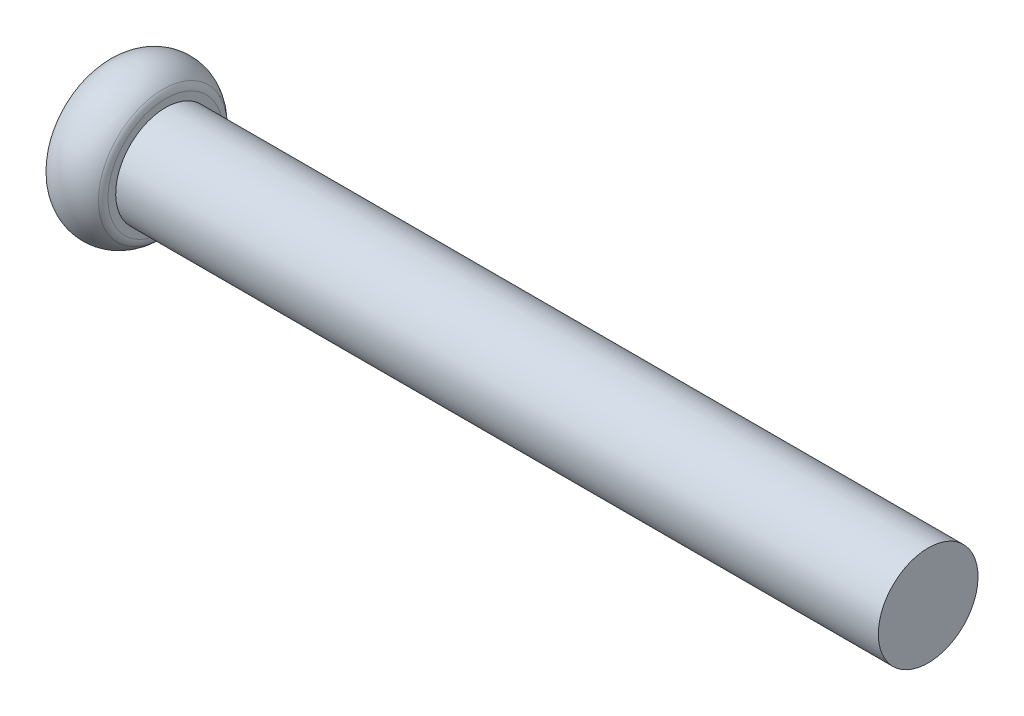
ISO-10303-21;
HEADER;
FILE_DESCRIPTION(('STEP AP214'),'2;1');
FILE_NAME('part.step','',(''),(''),'','','');
FILE_SCHEMA(('AUTOMOTIVE_DESIGN { 1 0 10303 214 1 1 1 1 }'));
ENDSEC;
DATA;
#1=APPLICATION_CONTEXT('core data for automotive mechanical design processes');
#2=APPLICATION_PROTOCOL_DEFINITION('international standard','automotive_design',2000,#1);
#3=PRODUCT_CONTEXT('',#1,'mechanical');
#4=PRODUCT('Part','Part','',(#3));
#5=PRODUCT_RELATED_PRODUCT_CATEGORY('part','',(#4));
#6=PRODUCT_DEFINITION_FORMATION('','',#4);
#7=PRODUCT_DEFINITION_CONTEXT('part definition',#1,'design');
#8=PRODUCT_DEFINITION('design','',#6,#7);
#9=PRODUCT_DEFINITION_SHAPE('','',#8);
#10=(LENGTH_UNIT() NAMED_UNIT(*) SI_UNIT(.MILLI.,.METRE.));
#11=(NAMED_UNIT(*) PLANE_ANGLE_UNIT() SI_UNIT($,.RADIAN.));
#12=(NAMED_UNIT(*) SI_UNIT($,.STERADIAN.) SOLID_ANGLE_UNIT());
#13=UNCERTAINTY_MEASURE_WITH_UNIT(LENGTH_MEASURE(1.E-05),#10,'distance_accuracy_value','');
#14=(GEOMETRIC_REPRESENTATION_CONTEXT(3) GLOBAL_UNCERTAINTY_ASSIGNED_CONTEXT((#13)) GLOBAL_UNIT_ASSIGNED_CONTEXT((#10,
#11,#12)) REPRESENTATION_CONTEXT('',''));
#15=CARTESIAN_POINT('',(0.,0.,0.));
#16=DIRECTION('',(0.,0.,1.));
#17=DIRECTION('',(1.,0.,0.));
#18=AXIS2_PLACEMENT_3D('',#15,#16,#17);
#19=CARTESIAN_POINT('',(0.,0.,0.));
#20=DIRECTION('',(-1.,0.,0.));
#21=DIRECTION('',(0.,-1.,0.));
#22=AXIS2_PLACEMENT_3D('',#19,#20,#21);
#23=PLANE('',#22);
#24=DIRECTION('',(0.,-1.,0.));
#25=VECTOR('',#24,1.);
#26=CARTESIAN_POINT('',(0.,-1.175,-0.299999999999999));
#27=LINE('',#26,#25);
#28=CARTESIAN_POINT('',(0.,-0.300000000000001,-0.299999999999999));
#29=VERTEX_POINT('',#28);
#30=CARTESIAN_POINT('',(0.,-0.734597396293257,-0.3));
#31=VERTEX_POINT('',#30);
#32=EDGE_CURVE('E584',#29,#31,#27,.T.);
#33=ORIENTED_EDGE('',*,*,#32,.F.);
#34=DIRECTION('',(0.,0.,1.));
#35=VECTOR('',#34,1.);
#36=CARTESIAN_POINT('',(0.,-0.299999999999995,1.175));
#37=LINE('',#36,#35);
#38=CARTESIAN_POINT('',(0.,-0.300000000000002,-0.734597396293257));
#39=VERTEX_POINT('',#38);
#40=EDGE_CURVE('E76',#39,#29,#37,.T.);
#41=ORIENTED_EDGE('',*,*,#40,.F.);
#42=CARTESIAN_POINT('',(0.,0.,0.));
#43=DIRECTION('',(1.,0.,0.));
#44=DIRECTION('',(0.,1.,0.));
#45=AXIS2_PLACEMENT_3D('',#42,#43,#44);
#46=CIRCLE('',#45,0.793494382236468);
#47=EDGE_CURVE('E543',#31,#39,#46,.T.);
#48=ORIENTED_EDGE('',*,*,#47,.F.);
#49=EDGE_LOOP('',(#33,#41,#48));
#50=FACE_BOUND('',#49,.T.);
#51=ADVANCED_FACE('F52',(#50),#23,.T.);
#52=CARTESIAN_POINT('',(0.,-0.299999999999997,0.734597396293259));
#53=VERTEX_POINT('',#52);
#54=CARTESIAN_POINT('',(0.,-0.73462282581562,0.299999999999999));
#55=VERTEX_POINT('',#54);
#56=EDGE_CURVE('E611',#53,#55,#46,.T.);
#57=ORIENTED_EDGE('',*,*,#56,.F.);
#58=CARTESIAN_POINT('',(0.,-0.299999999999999,0.3));
#59=VERTEX_POINT('',#58);
#60=EDGE_CURVE('E363',#59,#53,#37,.T.);
#61=ORIENTED_EDGE('',*,*,#60,.F.);
#62=DIRECTION('',(0.,1.,0.));
#63=VECTOR('',#62,1.);
#64=CARTESIAN_POINT('',(0.,1.175,0.299999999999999));
#65=LINE('',#64,#63);
#66=EDGE_CURVE('E586',#55,#59,#65,.T.);
#67=ORIENTED_EDGE('',*,*,#66,.F.);
#68=EDGE_LOOP('',(#57,#61,#67));
#69=FACE_BOUND('',#68,.T.);
#70=ADVANCED_FACE('F641',(#69),#23,.T.);
#71=CARTESIAN_POINT('',(0.,-1.175,0.299999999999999));
#72=DIRECTION('',(-0.0383776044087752,0.,0.999263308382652));
#73=DIRECTION('',(0.999263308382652,0.,0.0383776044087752));
#74=AXIS2_PLACEMENT_3D('',#71,#72,#73);
#75=PLANE('',#74);
#76=DIRECTION('',(-0.998528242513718,0.038349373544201,-0.0383493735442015));
#77=VECTOR('',#76,1.);
#78=CARTESIAN_POINT('',(0.033506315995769,-0.301286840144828,0.301286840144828));
#79=LINE('',#78,#77);
#80=CARTESIAN_POINT('',(1.30188338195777,-0.349999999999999,0.35));
#81=VERTEX_POINT('',#80);
#82=EDGE_CURVE('E544',#81,#59,#79,.T.);
#83=ORIENTED_EDGE('',*,*,#82,.F.);
#84=DIRECTION('',(0.,-1.,0.));
#85=VECTOR('',#84,1.);
#86=CARTESIAN_POINT('',(1.30188338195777,0.44201414,0.35));
#87=LINE('',#86,#85);
#88=CARTESIAN_POINT('',(1.30188338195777,-0.44201414,0.35));
#89=VERTEX_POINT('',#88);
#90=EDGE_CURVE('E392',#81,#89,#87,.T.);
#91=ORIENTED_EDGE('',*,*,#90,.T.);
#92=DIRECTION('',(0.870894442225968,0.490330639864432,0.0334474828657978));
#93=VECTOR('',#92,1.);
#94=CARTESIAN_POINT('',(0.,-1.175,0.299999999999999));
#95=LINE('',#94,#93);
#96=CARTESIAN_POINT('',(0.0983845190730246,-1.1196075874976,0.30377854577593));
#97=VERTEX_POINT('',#96);
#98=EDGE_CURVE('E514',#97,#89,#95,.T.);
#99=ORIENTED_EDGE('',*,*,#98,.F.);
#100=CARTESIAN_POINT('',(0.113438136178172,-1.14520643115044,0.304356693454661));
#101=CARTESIAN_POINT('',(0.102044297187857,-1.12668976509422,0.303919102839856));
#102=CARTESIAN_POINT('',(0.0914723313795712,-1.10768079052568,0.303513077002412));
#103=CARTESIAN_POINT('',(0.0720202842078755,-1.06882227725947,0.302766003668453));
#104=CARTESIAN_POINT('',(0.0631396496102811,-1.04897301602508,0.302424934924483));
#105=CARTESIAN_POINT('',(0.0393011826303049,-0.988878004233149,0.301509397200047));
#106=CARTESIAN_POINT('',(0.02685416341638,-0.947604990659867,0.301031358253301));
#107=CARTESIAN_POINT('',(0.00886680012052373,-0.863624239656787,0.300340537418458));
#108=CARTESIAN_POINT('',(0.00332567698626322,-0.820916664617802,0.300127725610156));
#109=CARTESIAN_POINT('',(-0.00110919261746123,-0.734894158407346,0.299957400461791));
#110=CARTESIAN_POINT('',(3.9984639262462E-05,-0.691577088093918,0.300001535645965));
#111=CARTESIAN_POINT('',(0.0075445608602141,-0.615029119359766,0.300289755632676));
#112=CARTESIAN_POINT('',(0.0127030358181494,-0.58166944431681,0.300487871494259));
#113=CARTESIAN_POINT('',(0.0262958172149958,-0.515563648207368,0.301009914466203));
#114=CARTESIAN_POINT('',(0.0347369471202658,-0.48281895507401,0.301334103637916));
#115=CARTESIAN_POINT('',(0.0541314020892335,-0.41845677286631,0.302078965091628));
#116=CARTESIAN_POINT('',(0.0650593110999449,-0.386831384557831,0.302498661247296));
#117=CARTESIAN_POINT('',(0.0826187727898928,-0.339928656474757,0.303173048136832));
#118=CARTESIAN_POINT('',(0.088651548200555,-0.324418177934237,0.303404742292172));
#119=CARTESIAN_POINT('',(0.100929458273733,-0.293491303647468,0.303876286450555));
#120=CARTESIAN_POINT('',(0.107174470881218,-0.278074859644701,0.304116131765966));
#121=CARTESIAN_POINT('',(0.11343813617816,-0.262666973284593,0.304356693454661));
#122=B_SPLINE_CURVE_WITH_KNOTS('',3,(#100,#101,#102,#103,#104,#105,#106,#107,#108,#109,#110,
#111,#112,#113,#114,#115,#116,#117,#118,#119,#120,#121),.UNSPECIFIED.,.F.,.F.,(4,2,2,2,2,2,2,2,
2,2,4),(0.,0.0651933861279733,0.13036541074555,0.259044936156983,0.387709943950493,
0.517201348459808,0.618296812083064,0.719603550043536,0.819918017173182,0.869849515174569,
0.919752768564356),.UNSPECIFIED.);
#123=EDGE_CURVE('E482',#97,#55,#122,.T.);
#124=ORIENTED_EDGE('',*,*,#123,.T.);
#125=ORIENTED_EDGE('',*,*,#66,.T.);
#126=EDGE_LOOP('',(#83,#91,#99,#124,#125));
#127=FACE_BOUND('',#126,.T.);
#128=ADVANCED_FACE('F637',(#127),#75,.F.);
#129=CARTESIAN_POINT('',(1.30188338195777,0.44201414,-0.35));
#130=DIRECTION('',(0.0383776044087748,0.,0.999263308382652));
#131=DIRECTION('',(0.999263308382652,0.,-0.0383776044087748));
#132=AXIS2_PLACEMENT_3D('',#129,#130,#131);
#133=PLANE('',#132);
#134=DIRECTION('',(0.,1.,0.));
#135=VECTOR('',#134,1.);
#136=CARTESIAN_POINT('',(1.30188338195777,-0.44201414,-0.35));
#137=LINE('',#136,#135);
#138=CARTESIAN_POINT('',(1.30188338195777,-0.44201414,-0.35));
#139=VERTEX_POINT('',#138);
#140=CARTESIAN_POINT('',(1.30188338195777,-0.350000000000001,-0.35));
#141=VERTEX_POINT('',#140);
#142=EDGE_CURVE('E424',#139,#141,#137,.T.);
#143=ORIENTED_EDGE('',*,*,#142,.T.);
#144=DIRECTION('',(-0.998528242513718,0.0383493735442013,0.0383493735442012));
#145=VECTOR('',#144,1.);
#146=CARTESIAN_POINT('',(1.27155483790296,-0.348835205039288,-0.348835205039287));
#147=LINE('',#146,#145);
#148=EDGE_CURVE('E171',#141,#29,#147,.T.);
#149=ORIENTED_EDGE('',*,*,#148,.T.);
#150=ORIENTED_EDGE('',*,*,#32,.T.);
#151=CARTESIAN_POINT('',(0.113438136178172,-1.14520643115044,-0.304356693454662));
#152=CARTESIAN_POINT('',(0.102044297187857,-1.12668976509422,-0.303919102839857));
#153=CARTESIAN_POINT('',(0.0914723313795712,-1.10768079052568,-0.303513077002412));
#154=CARTESIAN_POINT('',(0.0720202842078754,-1.06882227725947,-0.302766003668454));
#155=CARTESIAN_POINT('',(0.063139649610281,-1.04897301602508,-0.302424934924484));
#156=CARTESIAN_POINT('',(0.0393011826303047,-0.988878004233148,-0.301509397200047));
#157=CARTESIAN_POINT('',(0.0268541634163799,-0.947604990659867,-0.301031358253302));
#158=CARTESIAN_POINT('',(0.00886680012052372,-0.863624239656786,-0.300340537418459));
#159=CARTESIAN_POINT('',(0.00332567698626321,-0.820916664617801,-0.300127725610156));
#160=CARTESIAN_POINT('',(-0.0011091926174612,-0.734894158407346,-0.299957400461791));
#161=CARTESIAN_POINT('',(3.99846392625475E-05,-0.691577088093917,-0.300001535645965));
#162=CARTESIAN_POINT('',(0.00754456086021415,-0.615029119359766,-0.300289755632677));
#163=CARTESIAN_POINT('',(0.0127030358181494,-0.58166944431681,-0.30048787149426));
#164=CARTESIAN_POINT('',(0.0262958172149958,-0.515563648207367,-0.301009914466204));
#165=CARTESIAN_POINT('',(0.0347369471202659,-0.482818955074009,-0.301334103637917));
#166=CARTESIAN_POINT('',(0.0541314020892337,-0.418456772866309,-0.302078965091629));
#167=CARTESIAN_POINT('',(0.065059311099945,-0.386831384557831,-0.302498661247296));
#168=CARTESIAN_POINT('',(0.0826187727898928,-0.339928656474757,-0.303173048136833));
#169=CARTESIAN_POINT('',(0.088651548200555,-0.324418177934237,-0.303404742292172));
#170=CARTESIAN_POINT('',(0.100929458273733,-0.293491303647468,-0.303876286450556));
#171=CARTESIAN_POINT('',(0.107174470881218,-0.278074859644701,-0.304116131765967));
#172=CARTESIAN_POINT('',(0.11343813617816,-0.262666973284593,-0.304356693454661));
#173=B_SPLINE_CURVE_WITH_KNOTS('',3,(#151,#152,#153,#154,#155,#156,#157,#158,#159,#160,#161,
#162,#163,#164,#165,#166,#167,#168,#169,#170,#171,#172),.UNSPECIFIED.,.F.,.F.,(4,2,2,2,2,2,2,2,
2,2,4),(0.,0.0651933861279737,0.13036541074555,0.259044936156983,0.387709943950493,
0.517201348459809,0.618296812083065,0.719603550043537,0.819918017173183,0.869849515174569,
0.919752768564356),.UNSPECIFIED.);
#174=CARTESIAN_POINT('',(0.0983845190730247,-1.1196075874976,-0.30377854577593));
#175=VERTEX_POINT('',#174);
#176=EDGE_CURVE('E471',#175,#31,#173,.T.);
#177=ORIENTED_EDGE('',*,*,#176,.F.);
#178=DIRECTION('',(0.870894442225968,0.490330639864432,-0.0334474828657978));
#179=VECTOR('',#178,1.);
#180=CARTESIAN_POINT('',(0.,-1.175,-0.299999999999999));
#181=LINE('',#180,#179);
#182=EDGE_CURVE('E511',#175,#139,#181,.T.);
#183=ORIENTED_EDGE('',*,*,#182,.T.);
#184=EDGE_LOOP('',(#143,#149,#150,#177,#183));
#185=FACE_BOUND('',#184,.T.);
#186=ADVANCED_FACE('F449',(#185),#133,.T.);
#187=DIRECTION('',(0.,0.,-1.));
#188=VECTOR('',#187,1.);
#189=CARTESIAN_POINT('',(0.,0.299999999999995,-1.175));
#190=LINE('',#189,#188);
#191=CARTESIAN_POINT('',(0.,0.299999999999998,-0.3));
#192=VERTEX_POINT('',#191);
#193=CARTESIAN_POINT('',(0.,0.300003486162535,-0.734589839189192));
#194=VERTEX_POINT('',#193);
#195=EDGE_CURVE('E548',#192,#194,#190,.T.);
#196=ORIENTED_EDGE('',*,*,#195,.F.);
#197=CARTESIAN_POINT('',(0.,0.734597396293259,-0.299999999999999));
#198=VERTEX_POINT('',#197);
#199=EDGE_CURVE('E579',#198,#192,#27,.T.);
#200=ORIENTED_EDGE('',*,*,#199,.F.);
#201=EDGE_CURVE('E580',#194,#198,#46,.T.);
#202=ORIENTED_EDGE('',*,*,#201,.F.);
#203=EDGE_LOOP('',(#196,#200,#202));
#204=FACE_BOUND('',#203,.T.);
#205=ADVANCED_FACE('F578',(#204),#23,.T.);
#206=CARTESIAN_POINT('',(1.30188338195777,1.,0.));
#207=DIRECTION('',(1.,0.,0.));
#208=DIRECTION('',(0.,1.,0.));
#209=AXIS2_PLACEMENT_3D('',#206,#207,#208);
#210=PLANE('',#209);
#211=CARTESIAN_POINT('',(1.30188338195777,0.,0.));
#212=DIRECTION('',(1.,0.,0.));
#213=DIRECTION('',(0.,1.,0.));
#214=AXIS2_PLACEMENT_3D('',#211,#212,#213);
#215=CIRCLE('',#214,1.1549647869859);
#216=CARTESIAN_POINT('',(1.30188338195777,1.1549647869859,0.));
#217=VERTEX_POINT('',#216);
#218=EDGE_CURVE('E60',#217,#217,#215,.T.);
#219=ORIENTED_EDGE('',*,*,#218,.T.);
#220=EDGE_LOOP('',(#219));
#221=FACE_BOUND('',#220,.T.);
#222=CARTESIAN_POINT('',(1.30188338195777,0.,0.));
#223=DIRECTION('',(1.,0.,0.));
#224=DIRECTION('',(0.,1.,0.));
#225=AXIS2_PLACEMENT_3D('',#222,#223,#224);
#226=CIRCLE('',#225,1.);
#227=CARTESIAN_POINT('',(1.30188338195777,1.,0.));
#228=VERTEX_POINT('',#227);
#229=EDGE_CURVE('E624',#228,#228,#226,.T.);
#230=ORIENTED_EDGE('',*,*,#229,.F.);
#231=EDGE_LOOP('',(#230));
#232=FACE_BOUND('',#231,.T.);
#233=ADVANCED_FACE('F671',(#221,#232),#210,.T.);
#234=CARTESIAN_POINT('',(22.1447557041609,0.,0.));
#235=DIRECTION('',(1.,0.,0.));
#236=DIRECTION('',(0.,1.,0.));
#237=AXIS2_PLACEMENT_3D('',#234,#235,#236);
#238=CYLINDRICAL_SURFACE('',#237,1.);
#239=ORIENTED_EDGE('',*,*,#229,.T.);
#240=EDGE_LOOP('',(#239));
#241=FACE_BOUND('',#240,.T.);
#242=CARTESIAN_POINT('',(16.6,0.,0.));
#243=DIRECTION('',(1.,0.,0.));
#244=DIRECTION('',(0.,1.,0.));
#245=AXIS2_PLACEMENT_3D('',#242,#243,#244);
#246=CIRCLE('',#245,1.);
#247=CARTESIAN_POINT('',(16.6,1.,0.));
#248=VERTEX_POINT('',#247);
#249=EDGE_CURVE('E627',#248,#248,#246,.T.);
#250=ORIENTED_EDGE('',*,*,#249,.F.);
#251=EDGE_LOOP('',(#250));
#252=FACE_BOUND('',#251,.T.);
#253=ADVANCED_FACE('F668',(#241,#252),#238,.T.);
#254=CARTESIAN_POINT('',(16.6,1.,0.));
#255=DIRECTION('',(1.,0.,0.));
#256=DIRECTION('',(0.,1.,0.));
#257=AXIS2_PLACEMENT_3D('',#254,#255,#256);
#258=PLANE('',#257);
#259=ORIENTED_EDGE('',*,*,#249,.T.);
#260=EDGE_LOOP('',(#259));
#261=FACE_BOUND('',#260,.T.);
#262=ADVANCED_FACE('F663',(#261),#258,.T.);
#263=CARTESIAN_POINT('',(0.,0.300000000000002,0.734597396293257));
#264=VERTEX_POINT('',#263);
#265=CARTESIAN_POINT('',(0.,0.3,0.299999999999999));
#266=VERTEX_POINT('',#265);
#267=EDGE_CURVE('E545',#264,#266,#190,.T.);
#268=ORIENTED_EDGE('',*,*,#267,.F.);
#269=CARTESIAN_POINT('',(0.,0.734597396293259,0.299999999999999));
#270=VERTEX_POINT('',#269);
#271=EDGE_CURVE('E615',#270,#264,#46,.T.);
#272=ORIENTED_EDGE('',*,*,#271,.F.);
#273=EDGE_CURVE('E583',#266,#270,#65,.T.);
#274=ORIENTED_EDGE('',*,*,#273,.F.);
#275=EDGE_LOOP('',(#268,#272,#274));
#276=FACE_BOUND('',#275,.T.);
#277=ADVANCED_FACE('F650',(#276),#23,.T.);
#278=CARTESIAN_POINT('',(0.732177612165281,0.,0.));
#279=DIRECTION('',(1.,0.,0.));
#280=DIRECTION('',(0.,1.,0.));
#281=AXIS2_PLACEMENT_3D('',#278,#279,#280);
#282=TOROIDAL_SURFACE('',#281,0.793494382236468,0.732177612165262);
#283=CARTESIAN_POINT('',(0.132975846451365,0.305107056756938,1.17529999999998));
#284=CARTESIAN_POINT('',(0.120867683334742,0.304642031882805,1.15760665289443));
#285=CARTESIAN_POINT('',(0.109538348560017,0.304206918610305,1.13939390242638));
#286=CARTESIAN_POINT('',(0.0884930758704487,0.303398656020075,1.10206499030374));
#287=CARTESIAN_POINT('',(0.078776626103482,0.303025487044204,1.0829491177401));
#288=CARTESIAN_POINT('',(0.0521004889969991,0.30200096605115,1.02439098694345));
#289=CARTESIAN_POINT('',(0.037639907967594,0.301445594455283,0.983776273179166));
#290=CARTESIAN_POINT('',(0.0156469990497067,0.300600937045,0.900820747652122));
#291=CARTESIAN_POINT('',(0.00810359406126,0.300311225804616,0.85848280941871));
#292=CARTESIAN_POINT('',(-0.000221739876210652,0.299991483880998,0.773318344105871));
#293=CARTESIAN_POINT('',(-0.00102964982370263,0.299960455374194,0.730494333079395));
#294=CARTESIAN_POINT('',(0.00283279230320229,0.300108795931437,0.658766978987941));
#295=CARTESIAN_POINT('',(0.0058466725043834,0.300224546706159,0.629756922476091));
#296=CARTESIAN_POINT('',(0.0145089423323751,0.300557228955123,0.57212704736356));
#297=CARTESIAN_POINT('',(0.0201580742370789,0.300774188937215,0.543507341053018));
#298=CARTESIAN_POINT('',(0.0338033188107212,0.301298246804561,0.486573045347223));
#299=CARTESIAN_POINT('',(0.0418201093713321,0.301606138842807,0.458263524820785));
#300=CARTESIAN_POINT('',(0.0596935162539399,0.3022925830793,0.402239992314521));
#301=CARTESIAN_POINT('',(0.069550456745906,0.302671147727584,0.37452608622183));
#302=CARTESIAN_POINT('',(0.0887460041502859,0.303408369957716,0.323928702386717));
#303=CARTESIAN_POINT('',(0.0979166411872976,0.303760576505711,0.300979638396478));
#304=CARTESIAN_POINT('',(0.116455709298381,0.304472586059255,0.255188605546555));
#305=CARTESIAN_POINT('',(0.125823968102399,0.304832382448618,0.232346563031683));
#306=CARTESIAN_POINT('',(0.143724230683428,0.305519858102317,0.186711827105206));
#307=CARTESIAN_POINT('',(0.152266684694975,0.305847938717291,0.163923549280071));
#308=CARTESIAN_POINT('',(0.163526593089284,0.306280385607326,0.129173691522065));
#309=CARTESIAN_POINT('',(0.167025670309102,0.306414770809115,0.117474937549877));
#310=CARTESIAN_POINT('',(0.173265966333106,0.306654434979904,0.0938533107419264));
#311=CARTESIAN_POINT('',(0.176005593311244,0.306759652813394,0.0819300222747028));
#312=CARTESIAN_POINT('',(0.178241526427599,0.306845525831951,0.0698951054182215));
#313=B_SPLINE_CURVE_WITH_KNOTS('',3,(#283,#284,#285,#286,#287,#288,#289,#290,#291,#292,#293,
#294,#295,#296,#297,#298,#299,#300,#301,#302,#303,#304,#305,#306,#307,#308,#309,#310,#311,#312),
.UNSPECIFIED.,.F.,.F.,(4,2,2,2,2,2,2,2,2,2,2,2,2,2,4),(0.,0.0642913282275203,0.128562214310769,
0.257240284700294,0.385711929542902,0.513687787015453,0.601068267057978,0.688473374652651,
0.776665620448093,0.864873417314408,0.939016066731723,1.01309655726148,1.08606393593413,
1.12267551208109,1.15936325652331),.UNSPECIFIED.);
#314=CARTESIAN_POINT('',(0.0983845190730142,0.303778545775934,1.1196075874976));
#315=VERTEX_POINT('',#314);
#316=EDGE_CURVE('E524',#315,#264,#313,.T.);
#317=ORIENTED_EDGE('',*,*,#316,.F.);
#318=CARTESIAN_POINT('',(0.104219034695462,-0.350299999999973,1.11632264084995));
#319=CARTESIAN_POINT('',(0.100278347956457,-0.321259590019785,1.11854132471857));
#320=CARTESIAN_POINT('',(0.0968941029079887,-0.292126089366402,1.12044672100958));
#321=CARTESIAN_POINT('',(0.0911656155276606,-0.233731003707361,1.12367197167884));
#322=CARTESIAN_POINT('',(0.0888211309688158,-0.204469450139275,1.12499196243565));
#323=CARTESIAN_POINT('',(0.0832565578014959,-0.116887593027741,1.12812492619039));
#324=CARTESIAN_POINT('',(0.0814629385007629,-0.0584437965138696,1.12913476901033));
#325=CARTESIAN_POINT('',(0.0814629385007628,0.0584437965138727,1.12913476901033));
#326=CARTESIAN_POINT('',(0.0832565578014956,0.116887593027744,1.12812492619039));
#327=CARTESIAN_POINT('',(0.0888211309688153,0.204469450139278,1.12499196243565));
#328=CARTESIAN_POINT('',(0.0911656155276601,0.233731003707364,1.12367197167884));
#329=CARTESIAN_POINT('',(0.096894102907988,0.292126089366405,1.12044672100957));
#330=CARTESIAN_POINT('',(0.100278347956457,0.321259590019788,1.11854132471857));
#331=CARTESIAN_POINT('',(0.104219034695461,0.350299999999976,1.11632264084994));
#332=B_SPLINE_CURVE_WITH_KNOTS('',3,(#318,#319,#320,#321,#322,#323,#324,#325,#326,#327,#328,
#329,#330,#331),.UNSPECIFIED.,.F.,.F.,(4,2,2,2,2,2,4),(0.,0.0881538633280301,0.176287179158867,
0.351566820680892,0.526846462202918,0.614979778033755,0.703133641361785),.UNSPECIFIED.);
#333=CARTESIAN_POINT('',(0.0983845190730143,-0.303778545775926,1.1196075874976));
#334=VERTEX_POINT('',#333);
#335=EDGE_CURVE('E280',#334,#315,#332,.T.);
#336=ORIENTED_EDGE('',*,*,#335,.F.);
#337=CARTESIAN_POINT('',(0.132975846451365,-0.305107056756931,1.17529999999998));
#338=CARTESIAN_POINT('',(0.120867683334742,-0.304642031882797,1.15760665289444));
#339=CARTESIAN_POINT('',(0.109538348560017,-0.304206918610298,1.13939390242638));
#340=CARTESIAN_POINT('',(0.0884930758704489,-0.303398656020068,1.10206499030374));
#341=CARTESIAN_POINT('',(0.0787766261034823,-0.303025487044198,1.0829491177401));
#342=CARTESIAN_POINT('',(0.0521004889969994,-0.302000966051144,1.02439098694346));
#343=CARTESIAN_POINT('',(0.0376399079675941,-0.301445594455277,0.983776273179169));
#344=CARTESIAN_POINT('',(0.0156469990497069,-0.300600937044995,0.900820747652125));
#345=CARTESIAN_POINT('',(0.00810359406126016,-0.300311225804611,0.858482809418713));
#346=CARTESIAN_POINT('',(-0.000221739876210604,-0.299991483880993,0.773318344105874));
#347=CARTESIAN_POINT('',(-0.00102964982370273,-0.299960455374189,0.730494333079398));
#348=CARTESIAN_POINT('',(0.00283279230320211,-0.300108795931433,0.658766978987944));
#349=CARTESIAN_POINT('',(0.00584667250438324,-0.300224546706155,0.629756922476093));
#350=CARTESIAN_POINT('',(0.0145089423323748,-0.30055722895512,0.572127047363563));
#351=CARTESIAN_POINT('',(0.0201580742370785,-0.300774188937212,0.543507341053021));
#352=CARTESIAN_POINT('',(0.0338033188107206,-0.301298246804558,0.486573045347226));
#353=CARTESIAN_POINT('',(0.0418201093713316,-0.301606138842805,0.458263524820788));
#354=CARTESIAN_POINT('',(0.0596935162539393,-0.302292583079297,0.402239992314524));
#355=CARTESIAN_POINT('',(0.0695504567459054,-0.302671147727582,0.374526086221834));
#356=CARTESIAN_POINT('',(0.0887460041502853,-0.303408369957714,0.32392870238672));
#357=CARTESIAN_POINT('',(0.0979166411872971,-0.303760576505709,0.30097963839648));
#358=CARTESIAN_POINT('',(0.116455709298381,-0.304472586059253,0.255188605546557));
#359=CARTESIAN_POINT('',(0.125823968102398,-0.304832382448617,0.232346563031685));
#360=CARTESIAN_POINT('',(0.143724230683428,-0.305519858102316,0.186711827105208));
#361=CARTESIAN_POINT('',(0.152266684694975,-0.30584793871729,0.163923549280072));
#362=CARTESIAN_POINT('',(0.163526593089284,-0.306280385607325,0.129173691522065));
#363=CARTESIAN_POINT('',(0.167025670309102,-0.306414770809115,0.117474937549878));
#364=CARTESIAN_POINT('',(0.173265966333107,-0.306654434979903,0.093853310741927));
#365=CARTESIAN_POINT('',(0.176005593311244,-0.306759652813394,0.0819300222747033));
#366=CARTESIAN_POINT('',(0.178241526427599,-0.306845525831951,0.0698951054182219));
#367=B_SPLINE_CURVE_WITH_KNOTS('',3,(#337,#338,#339,#340,#341,#342,#343,#344,#345,#346,#347,
#348,#349,#350,#351,#352,#353,#354,#355,#356,#357,#358,#359,#360,#361,#362,#363,#364,#365,#366),
.UNSPECIFIED.,.F.,.F.,(4,2,2,2,2,2,2,2,2,2,2,2,2,2,4),(0.,0.0642913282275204,0.128562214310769,
0.257240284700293,0.385711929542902,0.513687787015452,0.601068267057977,0.68847337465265,
0.776665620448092,0.864873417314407,0.939016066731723,1.01309655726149,1.08606393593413,
1.12267551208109,1.15936325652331),.UNSPECIFIED.);
#368=EDGE_CURVE('E352',#334,#53,#367,.T.);
#369=ORIENTED_EDGE('',*,*,#368,.T.);
#370=ORIENTED_EDGE('',*,*,#56,.T.);
#371=ORIENTED_EDGE('',*,*,#123,.F.);
#372=CARTESIAN_POINT('',(0.104219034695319,-1.11632264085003,-0.350299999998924));
#373=CARTESIAN_POINT('',(0.10027834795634,-1.11854132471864,-0.321259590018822));
#374=CARTESIAN_POINT('',(0.0968941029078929,-1.12044672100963,-0.292126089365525));
#375=CARTESIAN_POINT('',(0.0911656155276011,-1.12367197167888,-0.23373100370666));
#376=CARTESIAN_POINT('',(0.0888211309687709,-1.12499196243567,-0.204469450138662));
#377=CARTESIAN_POINT('',(0.0832565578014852,-1.1281249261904,-0.116887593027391));
#378=CARTESIAN_POINT('',(0.081462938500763,-1.12913476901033,-0.0584437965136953));
#379=CARTESIAN_POINT('',(0.0814629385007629,-1.12913476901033,0.0584437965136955));
#380=CARTESIAN_POINT('',(0.0832565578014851,-1.1281249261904,0.116887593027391));
#381=CARTESIAN_POINT('',(0.0888211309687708,-1.12499196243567,0.204469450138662));
#382=CARTESIAN_POINT('',(0.091165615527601,-1.12367197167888,0.23373100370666));
#383=CARTESIAN_POINT('',(0.0968941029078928,-1.12044672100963,0.292126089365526));
#384=CARTESIAN_POINT('',(0.10027834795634,-1.11854132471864,0.321259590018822));
#385=CARTESIAN_POINT('',(0.104219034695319,-1.11632264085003,0.350299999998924));
#386=B_SPLINE_CURVE_WITH_KNOTS('',3,(#372,#373,#374,#375,#376,#377,#378,#379,#380,#381,#382,
#383,#384,#385),.UNSPECIFIED.,.F.,.F.,(4,2,2,2,2,2,4),(0.,0.0881538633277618,0.176287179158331,
0.351566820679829,0.526846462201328,0.614979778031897,0.703133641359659),.UNSPECIFIED.);
#387=EDGE_CURVE('E477',#175,#97,#386,.T.);
#388=ORIENTED_EDGE('',*,*,#387,.F.);
#389=ORIENTED_EDGE('',*,*,#176,.T.);
#390=ORIENTED_EDGE('',*,*,#47,.T.);
#391=CARTESIAN_POINT('',(0.178241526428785,-0.306845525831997,-0.0698951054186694));
#392=CARTESIAN_POINT('',(0.175950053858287,-0.306757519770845,-0.0822286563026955));
#393=CARTESIAN_POINT('',(0.173129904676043,-0.30664920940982,-0.0944442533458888));
#394=CARTESIAN_POINT('',(0.166696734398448,-0.306402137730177,-0.118639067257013));
#395=CARTESIAN_POINT('',(0.163085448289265,-0.30626344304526,-0.130618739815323));
#396=CARTESIAN_POINT('',(0.151467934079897,-0.305817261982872,-0.166199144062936));
#397=CARTESIAN_POINT('',(0.142658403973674,-0.305478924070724,-0.189527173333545));
#398=CARTESIAN_POINT('',(0.124207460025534,-0.304770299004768,-0.236353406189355));
#399=CARTESIAN_POINT('',(0.114553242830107,-0.304399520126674,-0.259846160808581));
#400=CARTESIAN_POINT('',(0.0955130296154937,-0.303668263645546,-0.306969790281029));
#401=CARTESIAN_POINT('',(0.0861272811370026,-0.303307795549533,-0.330600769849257));
#402=CARTESIAN_POINT('',(0.0655964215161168,-0.302519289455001,-0.385342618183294));
#403=CARTESIAN_POINT('',(0.05476543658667,-0.302103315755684,-0.416575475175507));
#404=CARTESIAN_POINT('',(0.0355814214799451,-0.301366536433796,-0.479808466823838));
#405=CARTESIAN_POINT('',(0.0272279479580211,-0.301045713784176,-0.511808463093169));
#406=CARTESIAN_POINT('',(0.0137099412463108,-0.300526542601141,-0.576103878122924));
#407=CARTESIAN_POINT('',(0.00850946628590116,-0.300326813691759,-0.60839153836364));
#408=CARTESIAN_POINT('',(0.00158198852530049,-0.300060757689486,-0.673328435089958));
#409=CARTESIAN_POINT('',(-0.000146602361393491,-0.299994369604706,-0.705977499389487));
#410=CARTESIAN_POINT('',(0.00022057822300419,-0.300008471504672,-0.7827693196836));
#411=CARTESIAN_POINT('',(0.00387427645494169,-0.300148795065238,-0.826918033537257));
#412=CARTESIAN_POINT('',(0.0184805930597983,-0.300709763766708,-0.914203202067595));
#413=CARTESIAN_POINT('',(0.0294633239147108,-0.301131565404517,-0.957334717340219));
#414=CARTESIAN_POINT('',(0.0549963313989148,-0.302112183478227,-1.03038142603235));
#415=CARTESIAN_POINT('',(0.0679304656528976,-0.302608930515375,-1.06086953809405));
#416=CARTESIAN_POINT('',(0.0976286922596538,-0.303749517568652,-1.11974601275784));
#417=CARTESIAN_POINT('',(0.11437573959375,-0.304392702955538,-1.14814299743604));
#418=CARTESIAN_POINT('',(0.132975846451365,-0.305107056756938,-1.17529999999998));
#419=B_SPLINE_CURVE_WITH_KNOTS('',3,(#391,#392,#393,#394,#395,#396,#397,#398,#399,#400,#401,
#402,#403,#404,#405,#406,#407,#408,#409,#410,#411,#412,#413,#414,#415,#416,#417,#418),
.UNSPECIFIED.,.F.,.F.,(4,2,2,2,2,2,2,2,2,2,2,2,2,4),(0.,0.0375959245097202,0.0751102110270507,
0.149875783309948,0.226088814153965,0.302369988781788,0.40148060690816,0.500573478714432,
0.598514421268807,0.696410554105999,0.82871896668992,0.961574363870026,1.06066381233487,
1.15931870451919),.UNSPECIFIED.);
#420=CARTESIAN_POINT('',(0.0983845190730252,-0.303778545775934,-1.1196075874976));
#421=VERTEX_POINT('',#420);
#422=EDGE_CURVE('E350',#39,#421,#419,.T.);
#423=ORIENTED_EDGE('',*,*,#422,.T.);
#424=CARTESIAN_POINT('',(0.104219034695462,0.350299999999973,-1.11632264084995));
#425=CARTESIAN_POINT('',(0.100278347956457,0.321259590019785,-1.11854132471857));
#426=CARTESIAN_POINT('',(0.0968941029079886,0.292126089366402,-1.12044672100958));
#427=CARTESIAN_POINT('',(0.0911656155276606,0.233731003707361,-1.12367197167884));
#428=CARTESIAN_POINT('',(0.0888211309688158,0.204469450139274,-1.12499196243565));
#429=CARTESIAN_POINT('',(0.0832565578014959,0.116887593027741,-1.12812492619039));
#430=CARTESIAN_POINT('',(0.081462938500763,0.0584437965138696,-1.12913476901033));
#431=CARTESIAN_POINT('',(0.0814629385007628,-0.0584437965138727,-1.12913476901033));
#432=CARTESIAN_POINT('',(0.0832565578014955,-0.116887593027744,-1.12812492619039));
#433=CARTESIAN_POINT('',(0.0888211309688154,-0.204469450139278,-1.12499196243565));
#434=CARTESIAN_POINT('',(0.0911656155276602,-0.233731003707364,-1.12367197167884));
#435=CARTESIAN_POINT('',(0.0968941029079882,-0.292126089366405,-1.12044672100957));
#436=CARTESIAN_POINT('',(0.100278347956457,-0.321259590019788,-1.11854132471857));
#437=CARTESIAN_POINT('',(0.104219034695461,-0.350299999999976,-1.11632264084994));
#438=B_SPLINE_CURVE_WITH_KNOTS('',3,(#424,#425,#426,#427,#428,#429,#430,#431,#432,#433,#434,
#435,#436,#437),.UNSPECIFIED.,.F.,.F.,(4,2,2,2,2,2,4),(0.,0.08815386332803,0.176287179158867,
0.351566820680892,0.526846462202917,0.614979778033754,0.703133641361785),.UNSPECIFIED.);
#439=CARTESIAN_POINT('',(0.0983845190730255,0.303778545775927,-1.1196075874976));
#440=VERTEX_POINT('',#439);
#441=EDGE_CURVE('E188',#440,#421,#438,.T.);
#442=ORIENTED_EDGE('',*,*,#441,.F.);
#443=CARTESIAN_POINT('',(0.178241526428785,0.306845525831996,-0.0698951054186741));
#444=CARTESIAN_POINT('',(0.175950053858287,0.306757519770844,-0.0822286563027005));
#445=CARTESIAN_POINT('',(0.173129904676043,0.306649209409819,-0.0944442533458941));
#446=CARTESIAN_POINT('',(0.166696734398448,0.306402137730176,-0.118639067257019));
#447=CARTESIAN_POINT('',(0.163085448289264,0.306263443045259,-0.130618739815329));
#448=CARTESIAN_POINT('',(0.151467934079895,0.30581726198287,-0.166199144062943));
#449=CARTESIAN_POINT('',(0.142658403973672,0.305478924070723,-0.189527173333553));
#450=CARTESIAN_POINT('',(0.124207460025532,0.304770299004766,-0.236353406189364));
#451=CARTESIAN_POINT('',(0.114553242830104,0.304399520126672,-0.25984616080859));
#452=CARTESIAN_POINT('',(0.0955130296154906,0.303668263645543,-0.306969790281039));
#453=CARTESIAN_POINT('',(0.0861272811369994,0.303307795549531,-0.330600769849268));
#454=CARTESIAN_POINT('',(0.065596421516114,0.302519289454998,-0.385342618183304));
#455=CARTESIAN_POINT('',(0.0547654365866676,0.302103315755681,-0.416575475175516));
#456=CARTESIAN_POINT('',(0.0355814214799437,0.301366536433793,-0.479808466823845));
#457=CARTESIAN_POINT('',(0.0272279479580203,0.301045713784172,-0.511808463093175));
#458=CARTESIAN_POINT('',(0.0137099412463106,0.300526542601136,-0.576103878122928));
#459=CARTESIAN_POINT('',(0.00850946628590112,0.300326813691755,-0.608391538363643));
#460=CARTESIAN_POINT('',(0.00158198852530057,0.300060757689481,-0.673328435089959));
#461=CARTESIAN_POINT('',(-0.000146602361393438,0.299994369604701,-0.705977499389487));
#462=CARTESIAN_POINT('',(0.000220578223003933,0.300008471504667,-0.782769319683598));
#463=CARTESIAN_POINT('',(0.00387427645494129,0.300148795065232,-0.826918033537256));
#464=CARTESIAN_POINT('',(0.0184805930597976,0.300709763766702,-0.914203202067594));
#465=CARTESIAN_POINT('',(0.02946332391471,0.30113156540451,-0.957334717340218));
#466=CARTESIAN_POINT('',(0.0549963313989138,0.30211218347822,-1.03038142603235));
#467=CARTESIAN_POINT('',(0.0679304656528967,0.302608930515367,-1.06086953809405));
#468=CARTESIAN_POINT('',(0.0976286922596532,0.303749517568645,-1.11974601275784));
#469=CARTESIAN_POINT('',(0.11437573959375,0.30439270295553,-1.14814299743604));
#470=CARTESIAN_POINT('',(0.132975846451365,0.30510705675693,-1.17529999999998));
#471=B_SPLINE_CURVE_WITH_KNOTS('',3,(#443,#444,#445,#446,#447,#448,#449,#450,#451,#452,#453,
#454,#455,#456,#457,#458,#459,#460,#461,#462,#463,#464,#465,#466,#467,#468,#469,#470),
.UNSPECIFIED.,.F.,.F.,(4,2,2,2,2,2,2,2,2,2,2,2,2,4),(0.,0.0375959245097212,0.0751102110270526,
0.149875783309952,0.226088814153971,0.302369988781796,0.401480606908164,0.500573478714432,
0.598514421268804,0.696410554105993,0.828718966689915,0.96157436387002,1.06066381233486,
1.15931870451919),.UNSPECIFIED.);
#472=EDGE_CURVE('E527',#194,#440,#471,.T.);
#473=ORIENTED_EDGE('',*,*,#472,.F.);
#474=ORIENTED_EDGE('',*,*,#201,.T.);
#475=CARTESIAN_POINT('',(0.113438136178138,0.262666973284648,-0.30435669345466));
#476=CARTESIAN_POINT('',(0.106571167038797,0.27954652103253,-0.304092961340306));
#477=CARTESIAN_POINT('',(0.0997318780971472,0.296441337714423,-0.303830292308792));
#478=CARTESIAN_POINT('',(0.0863274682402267,0.330354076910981,-0.303315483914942));
#479=CARTESIAN_POINT('',(0.0797625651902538,0.347372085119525,-0.303063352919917));
#480=CARTESIAN_POINT('',(0.0670990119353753,0.381701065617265,-0.302576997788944));
#481=CARTESIAN_POINT('',(0.0610034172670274,0.399013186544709,-0.30234289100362));
#482=CARTESIAN_POINT('',(0.04948643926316,0.433854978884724,-0.301900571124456));
#483=CARTESIAN_POINT('',(0.044064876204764,0.451384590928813,-0.301692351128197));
#484=CARTESIAN_POINT('',(0.0289165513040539,0.504679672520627,-0.301110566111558));
#485=CARTESIAN_POINT('',(0.0204359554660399,0.540816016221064,-0.300784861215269));
#486=CARTESIAN_POINT('',(0.00763205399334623,0.613745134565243,-0.300293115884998));
#487=CARTESIAN_POINT('',(0.00329750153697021,0.650535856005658,-0.300126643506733));
#488=CARTESIAN_POINT('',(7.76547734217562E-05,0.709694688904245,-0.300002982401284));
#489=CARTESIAN_POINT('',(-0.000288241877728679,0.731986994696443,-0.299988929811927));
#490=CARTESIAN_POINT('',(0.00074281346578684,0.776536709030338,-0.300028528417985));
#491=CARTESIAN_POINT('',(0.0021404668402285,0.798794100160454,-0.300082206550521));
#492=CARTESIAN_POINT('',(0.00904298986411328,0.864978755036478,-0.300347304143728));
#493=CARTESIAN_POINT('',(0.0172367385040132,0.908667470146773,-0.300661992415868));
#494=CARTESIAN_POINT('',(0.0385254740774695,0.985251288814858,-0.301479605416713));
#495=CARTESIAN_POINT('',(0.0502772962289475,1.01852815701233,-0.301930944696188));
#496=CARTESIAN_POINT('',(0.0784002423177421,1.08339095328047,-0.303011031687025));
#497=CARTESIAN_POINT('',(0.0948088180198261,1.11496059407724,-0.303641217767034));
#498=CARTESIAN_POINT('',(0.113438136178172,1.14520643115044,-0.304356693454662));
#499=B_SPLINE_CURVE_WITH_KNOTS('',3,(#475,#476,#477,#478,#479,#480,#481,#482,#483,#484,#485,
#486,#487,#488,#489,#490,#491,#492,#493,#494,#495,#496,#497,#498),.UNSPECIFIED.,.F.,.F.,(4,2,2,
2,2,2,2,2,2,2,2,4),(0.,0.0546804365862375,0.109403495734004,0.164457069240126,0.219495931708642,
0.330648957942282,0.441499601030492,0.508319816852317,0.575166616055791,0.707823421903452,
0.813380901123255,0.919812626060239),.UNSPECIFIED.);
#500=CARTESIAN_POINT('',(0.098384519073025,1.1196075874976,-0.30377854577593));
#501=VERTEX_POINT('',#500);
#502=EDGE_CURVE('E467',#198,#501,#499,.T.);
#503=ORIENTED_EDGE('',*,*,#502,.T.);
#504=CARTESIAN_POINT('',(0.104219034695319,1.11632264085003,0.350299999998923));
#505=CARTESIAN_POINT('',(0.10027834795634,1.11854132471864,0.321259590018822));
#506=CARTESIAN_POINT('',(0.0968941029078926,1.12044672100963,0.292126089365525));
#507=CARTESIAN_POINT('',(0.0911656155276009,1.12367197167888,0.233731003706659));
#508=CARTESIAN_POINT('',(0.0888211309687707,1.12499196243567,0.204469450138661));
#509=CARTESIAN_POINT('',(0.0832565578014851,1.1281249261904,0.116887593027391));
#510=CARTESIAN_POINT('',(0.0814629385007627,1.12913476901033,0.0584437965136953));
#511=CARTESIAN_POINT('',(0.0814629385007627,1.12913476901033,-0.0584437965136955));
#512=CARTESIAN_POINT('',(0.0832565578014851,1.1281249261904,-0.116887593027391));
#513=CARTESIAN_POINT('',(0.0888211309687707,1.12499196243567,-0.204469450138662));
#514=CARTESIAN_POINT('',(0.0911656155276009,1.12367197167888,-0.23373100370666));
#515=CARTESIAN_POINT('',(0.0968941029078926,1.12044672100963,-0.292126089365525));
#516=CARTESIAN_POINT('',(0.10027834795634,1.11854132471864,-0.321259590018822));
#517=CARTESIAN_POINT('',(0.104219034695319,1.11632264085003,-0.350299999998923));
#518=B_SPLINE_CURVE_WITH_KNOTS('',3,(#504,#505,#506,#507,#508,#509,#510,#511,#512,#513,#514,
#515,#516,#517),.UNSPECIFIED.,.F.,.F.,(4,2,2,2,2,2,4),(0.,0.0881538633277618,0.176287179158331,
0.351566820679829,0.526846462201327,0.614979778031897,0.703133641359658),.UNSPECIFIED.);
#519=CARTESIAN_POINT('',(0.0983845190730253,1.1196075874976,0.303778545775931));
#520=VERTEX_POINT('',#519);
#521=EDGE_CURVE('E620',#520,#501,#518,.T.);
#522=ORIENTED_EDGE('',*,*,#521,.F.);
#523=CARTESIAN_POINT('',(0.113438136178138,0.262666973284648,0.30435669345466));
#524=CARTESIAN_POINT('',(0.106571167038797,0.27954652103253,0.304092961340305));
#525=CARTESIAN_POINT('',(0.0997318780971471,0.296441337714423,0.303830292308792));
#526=CARTESIAN_POINT('',(0.0863274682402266,0.330354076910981,0.303315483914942));
#527=CARTESIAN_POINT('',(0.0797625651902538,0.347372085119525,0.303063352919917));
#528=CARTESIAN_POINT('',(0.0670990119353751,0.381701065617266,0.302576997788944));
#529=CARTESIAN_POINT('',(0.0610034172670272,0.39901318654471,0.30234289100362));
#530=CARTESIAN_POINT('',(0.0494864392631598,0.433854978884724,0.301900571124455));
#531=CARTESIAN_POINT('',(0.0440648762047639,0.451384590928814,0.301692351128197));
#532=CARTESIAN_POINT('',(0.0289165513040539,0.504679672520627,0.301110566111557));
#533=CARTESIAN_POINT('',(0.0204359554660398,0.540816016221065,0.300784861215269));
#534=CARTESIAN_POINT('',(0.00763205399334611,0.613745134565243,0.300293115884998));
#535=CARTESIAN_POINT('',(0.00329750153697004,0.650535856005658,0.300126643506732));
#536=CARTESIAN_POINT('',(7.76547734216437E-05,0.709694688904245,0.300002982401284));
#537=CARTESIAN_POINT('',(-0.000288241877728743,0.731986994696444,0.299988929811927));
#538=CARTESIAN_POINT('',(0.00074281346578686,0.776536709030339,0.300028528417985));
#539=CARTESIAN_POINT('',(0.00214046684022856,0.798794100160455,0.300082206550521));
#540=CARTESIAN_POINT('',(0.00904298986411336,0.864978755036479,0.300347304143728));
#541=CARTESIAN_POINT('',(0.0172367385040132,0.908667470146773,0.300661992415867));
#542=CARTESIAN_POINT('',(0.0385254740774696,0.985251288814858,0.301479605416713));
#543=CARTESIAN_POINT('',(0.0502772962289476,1.01852815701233,0.301930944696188));
#544=CARTESIAN_POINT('',(0.0784002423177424,1.08339095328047,0.303011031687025));
#545=CARTESIAN_POINT('',(0.0948088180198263,1.11496059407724,0.303641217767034));
#546=CARTESIAN_POINT('',(0.113438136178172,1.14520643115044,0.304356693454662));
#547=B_SPLINE_CURVE_WITH_KNOTS('',3,(#523,#524,#525,#526,#527,#528,#529,#530,#531,#532,#533,
#534,#535,#536,#537,#538,#539,#540,#541,#542,#543,#544,#545,#546),.UNSPECIFIED.,.F.,.F.,(4,2,2,
2,2,2,2,2,2,2,2,4),(0.,0.0546804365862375,0.109403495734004,0.164457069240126,0.219495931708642,
0.330648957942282,0.441499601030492,0.508319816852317,0.575166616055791,0.707823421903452,
0.813380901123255,0.919812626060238),.UNSPECIFIED.);
#548=EDGE_CURVE('E469',#270,#520,#547,.T.);
#549=ORIENTED_EDGE('',*,*,#548,.F.);
#550=ORIENTED_EDGE('',*,*,#271,.T.);
#551=EDGE_LOOP('',(#317,#336,#369,#370,#371,#388,#389,#390,#423,#442,#473,#474,#503,#522,#549,#550));
#552=FACE_BOUND('',#551,.T.);
#553=CARTESIAN_POINT('',(0.11323813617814,0.,0.));
#554=DIRECTION('',(1.,0.,0.));
#555=DIRECTION('',(0.,1.,0.));
#556=AXIS2_PLACEMENT_3D('',#553,#554,#555);
#557=CIRCLE('',#556,1.18464394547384);
#558=CARTESIAN_POINT('',(0.11323813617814,1.18464394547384,0.));
#559=VERTEX_POINT('',#558);
#560=EDGE_CURVE('E610',#559,#559,#557,.T.);
#561=ORIENTED_EDGE('',*,*,#560,.F.);
#562=EDGE_LOOP('',(#561));
#563=FACE_BOUND('',#562,.T.);
#564=ADVANCED_FACE('F304',(#552,#563),#282,.T.);
#565=CARTESIAN_POINT('',(0.721883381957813,0.,0.));
#566=DIRECTION('',(1.,0.,0.));
#567=DIRECTION('',(0.,1.,0.));
#568=AXIS2_PLACEMENT_3D('',#565,#566,#567);
#569=TOROIDAL_SURFACE('',#568,0.799999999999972,0.719999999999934);
#570=CARTESIAN_POINT('',(1.24803722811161,0.,0.));
#571=DIRECTION('',(-1.,0.,0.));
#572=DIRECTION('',(0.,-1.,0.));
#573=AXIS2_PLACEMENT_3D('',#570,#571,#572);
#574=CIRCLE('',#573,1.29148970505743);
#575=CARTESIAN_POINT('',(1.24803722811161,-1.29148970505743,0.));
#576=VERTEX_POINT('',#575);
#577=EDGE_CURVE('E12',#576,#576,#574,.T.);
#578=ORIENTED_EDGE('',*,*,#577,.T.);
#579=EDGE_LOOP('',(#578));
#580=FACE_BOUND('',#579,.T.);
#581=ORIENTED_EDGE('',*,*,#560,.T.);
#582=EDGE_LOOP('',(#581));
#583=FACE_BOUND('',#582,.T.);
#584=ADVANCED_FACE('F217',(#580,#583),#569,.T.);
#585=CARTESIAN_POINT('',(1.30188338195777,0.44201414,-0.35));
#586=DIRECTION('',(-1.,0.,0.));
#587=DIRECTION('',(0.,0.,1.));
#588=AXIS2_PLACEMENT_3D('',#585,#586,#587);
#589=PLANE('',#588);
#590=CARTESIAN_POINT('',(1.30188338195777,0.349999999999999,-0.35));
#591=VERTEX_POINT('',#590);
#592=CARTESIAN_POINT('',(1.30188338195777,0.44201414,-0.35));
#593=VERTEX_POINT('',#592);
#594=EDGE_CURVE('E526',#591,#593,#137,.T.);
#595=ORIENTED_EDGE('',*,*,#594,.F.);
#596=DIRECTION('',(0.,0.,1.));
#597=VECTOR('',#596,1.);
#598=CARTESIAN_POINT('',(1.30188338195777,0.349999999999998,-0.442014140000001));
#599=LINE('',#598,#597);
#600=CARTESIAN_POINT('',(1.30188338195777,0.349999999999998,-0.442014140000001));
#601=VERTEX_POINT('',#600);
#602=EDGE_CURVE('E195',#601,#591,#599,.T.);
#603=ORIENTED_EDGE('',*,*,#602,.F.);
#604=DIRECTION('',(0.,1.,0.));
#605=VECTOR('',#604,1.);
#606=CARTESIAN_POINT('',(1.30188338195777,0.349999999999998,-0.442014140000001));
#607=LINE('',#606,#605);
#608=CARTESIAN_POINT('',(1.30188338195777,-0.350000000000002,-0.442014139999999));
#609=VERTEX_POINT('',#608);
#610=EDGE_CURVE('E185',#609,#601,#607,.T.);
#611=ORIENTED_EDGE('',*,*,#610,.F.);
#612=DIRECTION('',(0.,0.,-1.));
#613=VECTOR('',#612,1.);
#614=CARTESIAN_POINT('',(1.30188338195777,-0.349999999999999,0.442014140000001));
#615=LINE('',#614,#613);
#616=EDGE_CURVE('E165',#141,#609,#615,.T.);
#617=ORIENTED_EDGE('',*,*,#616,.F.);
#618=ORIENTED_EDGE('',*,*,#142,.F.);
#619=DIRECTION('',(0.,0.,-1.));
#620=VECTOR('',#619,1.);
#621=CARTESIAN_POINT('',(1.30188338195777,-0.44201414,-0.35));
#622=LINE('',#621,#620);
#623=EDGE_CURVE('E397',#89,#139,#622,.T.);
#624=ORIENTED_EDGE('',*,*,#623,.F.);
#625=ORIENTED_EDGE('',*,*,#90,.F.);
#626=CARTESIAN_POINT('',(1.30188338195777,-0.349999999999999,0.442014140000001));
#627=VERTEX_POINT('',#626);
#628=EDGE_CURVE('E67',#627,#81,#615,.T.);
#629=ORIENTED_EDGE('',*,*,#628,.F.);
#630=DIRECTION('',(0.,-1.,0.));
#631=VECTOR('',#630,1.);
#632=CARTESIAN_POINT('',(1.30188338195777,-0.349999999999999,0.442014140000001));
#633=LINE('',#632,#631);
#634=CARTESIAN_POINT('',(1.30188338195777,0.350000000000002,0.442014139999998));
#635=VERTEX_POINT('',#634);
#636=EDGE_CURVE('E375',#635,#627,#633,.T.);
#637=ORIENTED_EDGE('',*,*,#636,.F.);
#638=CARTESIAN_POINT('',(1.30188338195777,0.350000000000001,0.350000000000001));
#639=VERTEX_POINT('',#638);
#640=EDGE_CURVE('E197',#639,#635,#599,.T.);
#641=ORIENTED_EDGE('',*,*,#640,.F.);
#642=CARTESIAN_POINT('',(1.30188338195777,0.44201414,0.35));
#643=VERTEX_POINT('',#642);
#644=EDGE_CURVE('E395',#643,#639,#87,.T.);
#645=ORIENTED_EDGE('',*,*,#644,.F.);
#646=DIRECTION('',(0.,0.,1.));
#647=VECTOR('',#646,1.);
#648=CARTESIAN_POINT('',(1.30188338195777,0.44201414,0.35));
#649=LINE('',#648,#647);
#650=EDGE_CURVE('E415',#593,#643,#649,.T.);
#651=ORIENTED_EDGE('',*,*,#650,.F.);
#652=EDGE_LOOP('',(#595,#603,#611,#617,#618,#624,#625,#629,#637,#641,#645,#651));
#653=FACE_BOUND('',#652,.T.);
#654=ADVANCED_FACE('F194',(#653),#589,.T.);
#655=CARTESIAN_POINT('',(0.,-1.175,-0.299999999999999));
#656=DIRECTION('',(0.490605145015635,-0.871382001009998,0.));
#657=DIRECTION('',(0.871382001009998,0.490605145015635,0.));
#658=AXIS2_PLACEMENT_3D('',#655,#656,#657);
#659=PLANE('',#658);
#660=ORIENTED_EDGE('',*,*,#387,.T.);
#661=ORIENTED_EDGE('',*,*,#98,.T.);
#662=ORIENTED_EDGE('',*,*,#623,.T.);
#663=ORIENTED_EDGE('',*,*,#182,.F.);
#664=EDGE_LOOP('',(#660,#661,#662,#663));
#665=FACE_BOUND('',#664,.T.);
#666=ADVANCED_FACE('F216',(#665),#659,.F.);
#667=ORIENTED_EDGE('',*,*,#644,.T.);
#668=DIRECTION('',(-0.998528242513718,-0.0383493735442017,-0.0383493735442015));
#669=VECTOR('',#668,1.);
#670=CARTESIAN_POINT('',(-0.0564820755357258,0.297830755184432,0.297830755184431));
#671=LINE('',#670,#669);
#672=EDGE_CURVE('E354',#639,#266,#671,.T.);
#673=ORIENTED_EDGE('',*,*,#672,.T.);
#674=ORIENTED_EDGE('',*,*,#273,.T.);
#675=ORIENTED_EDGE('',*,*,#548,.T.);
#676=DIRECTION('',(0.870894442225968,-0.490330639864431,0.0334474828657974));
#677=VECTOR('',#676,1.);
#678=CARTESIAN_POINT('',(0.,1.175,0.299999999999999));
#679=LINE('',#678,#677);
#680=EDGE_CURVE('E411',#520,#643,#679,.T.);
#681=ORIENTED_EDGE('',*,*,#680,.T.);
#682=EDGE_LOOP('',(#667,#673,#674,#675,#681));
#683=FACE_BOUND('',#682,.T.);
#684=ADVANCED_FACE('F447',(#683),#75,.F.);
#685=DIRECTION('',(-0.998528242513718,-0.0383493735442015,0.0383493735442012));
#686=VECTOR('',#685,1.);
#687=CARTESIAN_POINT('',(1.30540687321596,0.350135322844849,-0.35013532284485));
#688=LINE('',#687,#686);
#689=EDGE_CURVE('E289',#591,#192,#688,.T.);
#690=ORIENTED_EDGE('',*,*,#689,.F.);
#691=ORIENTED_EDGE('',*,*,#594,.T.);
#692=DIRECTION('',(0.870894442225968,-0.490330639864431,-0.0334474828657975));
#693=VECTOR('',#692,1.);
#694=CARTESIAN_POINT('',(0.,1.175,-0.299999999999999));
#695=LINE('',#694,#693);
#696=EDGE_CURVE('E423',#501,#593,#695,.T.);
#697=ORIENTED_EDGE('',*,*,#696,.F.);
#698=ORIENTED_EDGE('',*,*,#502,.F.);
#699=ORIENTED_EDGE('',*,*,#199,.T.);
#700=EDGE_LOOP('',(#690,#691,#697,#698,#699));
#701=FACE_BOUND('',#700,.T.);
#702=ADVANCED_FACE('F439',(#701),#133,.T.);
#703=CARTESIAN_POINT('',(0.,1.175,0.299999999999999));
#704=DIRECTION('',(0.490605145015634,0.871382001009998,0.));
#705=DIRECTION('',(-0.871382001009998,0.490605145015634,0.));
#706=AXIS2_PLACEMENT_3D('',#703,#704,#705);
#707=PLANE('',#706);
#708=ORIENTED_EDGE('',*,*,#521,.T.);
#709=ORIENTED_EDGE('',*,*,#696,.T.);
#710=ORIENTED_EDGE('',*,*,#650,.T.);
#711=ORIENTED_EDGE('',*,*,#680,.F.);
#712=EDGE_LOOP('',(#708,#709,#710,#711));
#713=FACE_BOUND('',#712,.T.);
#714=ADVANCED_FACE('F218',(#713),#707,.F.);
#715=CARTESIAN_POINT('',(1.30188338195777,-0.350000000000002,-0.442014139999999));
#716=DIRECTION('',(0.0383776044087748,0.999263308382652,0.));
#717=DIRECTION('',(0.999263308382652,-0.0383776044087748,0.));
#718=AXIS2_PLACEMENT_3D('',#715,#716,#717);
#719=PLANE('',#718);
#720=ORIENTED_EDGE('',*,*,#40,.T.);
#721=ORIENTED_EDGE('',*,*,#148,.F.);
#722=ORIENTED_EDGE('',*,*,#616,.T.);
#723=DIRECTION('',(0.870894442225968,-0.0334474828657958,0.490330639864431));
#724=VECTOR('',#723,1.);
#725=CARTESIAN_POINT('',(0.,-0.300000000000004,-1.175));
#726=LINE('',#725,#724);
#727=EDGE_CURVE('E169',#421,#609,#726,.T.);
#728=ORIENTED_EDGE('',*,*,#727,.F.);
#729=ORIENTED_EDGE('',*,*,#422,.F.);
#730=EDGE_LOOP('',(#720,#721,#722,#728,#729));
#731=FACE_BOUND('',#730,.T.);
#732=ADVANCED_FACE('F168',(#731),#719,.T.);
#733=CARTESIAN_POINT('',(0.,0.300000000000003,1.175));
#734=DIRECTION('',(-0.0383776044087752,0.999263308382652,0.));
#735=DIRECTION('',(0.999263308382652,0.0383776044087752,0.));
#736=AXIS2_PLACEMENT_3D('',#733,#734,#735);
#737=PLANE('',#736);
#738=ORIENTED_EDGE('',*,*,#472,.T.);
#739=DIRECTION('',(0.870894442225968,0.0334474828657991,0.490330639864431));
#740=VECTOR('',#739,1.);
#741=CARTESIAN_POINT('',(0.,0.299999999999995,-1.175));
#742=LINE('',#741,#740);
#743=EDGE_CURVE('E190',#440,#601,#742,.T.);
#744=ORIENTED_EDGE('',*,*,#743,.T.);
#745=ORIENTED_EDGE('',*,*,#602,.T.);
#746=ORIENTED_EDGE('',*,*,#689,.T.);
#747=ORIENTED_EDGE('',*,*,#195,.T.);
#748=EDGE_LOOP('',(#738,#744,#745,#746,#747));
#749=FACE_BOUND('',#748,.T.);
#750=ADVANCED_FACE('F312',(#749),#737,.F.);
#751=CARTESIAN_POINT('',(0.,0.299999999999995,-1.175));
#752=DIRECTION('',(0.490605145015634,0.,-0.871382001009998));
#753=DIRECTION('',(-0.871382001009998,0.,-0.490605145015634));
#754=AXIS2_PLACEMENT_3D('',#751,#752,#753);
#755=PLANE('',#754);
#756=ORIENTED_EDGE('',*,*,#441,.T.);
#757=ORIENTED_EDGE('',*,*,#727,.T.);
#758=ORIENTED_EDGE('',*,*,#610,.T.);
#759=ORIENTED_EDGE('',*,*,#743,.F.);
#760=EDGE_LOOP('',(#756,#757,#758,#759));
#761=FACE_BOUND('',#760,.T.);
#762=ADVANCED_FACE('F183',(#761),#755,.F.);
#763=ORIENTED_EDGE('',*,*,#316,.T.);
#764=ORIENTED_EDGE('',*,*,#267,.T.);
#765=ORIENTED_EDGE('',*,*,#672,.F.);
#766=ORIENTED_EDGE('',*,*,#640,.T.);
#767=DIRECTION('',(0.870894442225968,0.0334474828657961,-0.490330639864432));
#768=VECTOR('',#767,1.);
#769=CARTESIAN_POINT('',(0.,0.300000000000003,1.175));
#770=LINE('',#769,#768);
#771=EDGE_CURVE('E360',#315,#635,#770,.T.);
#772=ORIENTED_EDGE('',*,*,#771,.F.);
#773=EDGE_LOOP('',(#763,#764,#765,#766,#772));
#774=FACE_BOUND('',#773,.T.);
#775=ADVANCED_FACE('F647',(#774),#737,.F.);
#776=DIRECTION('',(0.870894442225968,-0.0334474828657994,-0.490330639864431));
#777=VECTOR('',#776,1.);
#778=CARTESIAN_POINT('',(0.,-0.299999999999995,1.175));
#779=LINE('',#778,#777);
#780=EDGE_CURVE('E189',#334,#627,#779,.T.);
#781=ORIENTED_EDGE('',*,*,#780,.T.);
#782=ORIENTED_EDGE('',*,*,#628,.T.);
#783=ORIENTED_EDGE('',*,*,#82,.T.);
#784=ORIENTED_EDGE('',*,*,#60,.T.);
#785=ORIENTED_EDGE('',*,*,#368,.F.);
#786=EDGE_LOOP('',(#781,#782,#783,#784,#785));
#787=FACE_BOUND('',#786,.T.);
#788=ADVANCED_FACE('F311',(#787),#719,.T.);
#789=CARTESIAN_POINT('',(0.,-0.299999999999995,1.175));
#790=DIRECTION('',(0.490605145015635,0.,0.871382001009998));
#791=DIRECTION('',(0.871382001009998,0.,-0.490605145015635));
#792=AXIS2_PLACEMENT_3D('',#789,#790,#791);
#793=PLANE('',#792);
#794=ORIENTED_EDGE('',*,*,#335,.T.);
#795=ORIENTED_EDGE('',*,*,#771,.T.);
#796=ORIENTED_EDGE('',*,*,#636,.T.);
#797=ORIENTED_EDGE('',*,*,#780,.F.);
#798=EDGE_LOOP('',(#794,#795,#796,#797));
#799=FACE_BOUND('',#798,.T.);
#800=ADVANCED_FACE('F307',(#799),#793,.F.);
#801=CARTESIAN_POINT('',(1.10188338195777,0.,0.));
#802=DIRECTION('',(1.,0.,0.));
#803=DIRECTION('',(0.,1.,0.));
#804=AXIS2_PLACEMENT_3D('',#801,#802,#803);
#805=TOROIDAL_SURFACE('',#804,1.1549647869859,0.2);
#806=ORIENTED_EDGE('',*,*,#577,.F.);
#807=EDGE_LOOP('',(#806));
#808=FACE_BOUND('',#807,.T.);
#809=ORIENTED_EDGE('',*,*,#218,.F.);
#810=EDGE_LOOP('',(#809));
#811=FACE_BOUND('',#810,.T.);
#812=ADVANCED_FACE('F54',(#808,#811),#805,.T.);
#813=CLOSED_SHELL('',(#51,#70,#128,#186,#205,#233,#253,#262,#277,#564,#584,#654,#666,#684,#702,
#714,#732,#750,#762,#775,#788,#800,#812));
#814=MANIFOLD_SOLID_BREP('B2',#813);
#815=ADVANCED_BREP_SHAPE_REPRESENTATION('',(#18,#814),#14);
#816=SHAPE_DEFINITION_REPRESENTATION(#9,#815);
ENDSEC;
END-ISO-10303-21;
